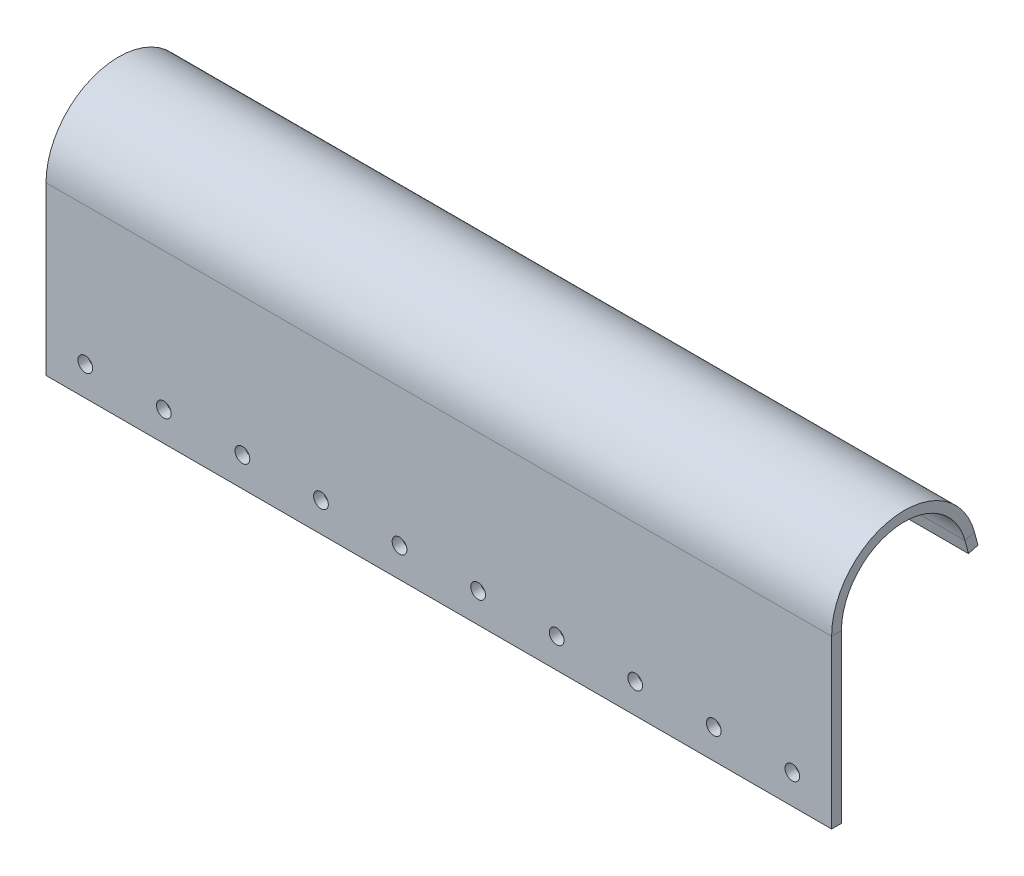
ISO-10303-21;
HEADER;
FILE_DESCRIPTION(('STEP AP214'),'2;1');
FILE_NAME('part.step','',(''),(''),'','','');
FILE_SCHEMA(('AUTOMOTIVE_DESIGN { 1 0 10303 214 1 1 1 1 }'));
ENDSEC;
DATA;
#1=APPLICATION_CONTEXT('core data for automotive mechanical design processes');
#2=APPLICATION_PROTOCOL_DEFINITION('international standard','automotive_design',2000,#1);
#3=PRODUCT_CONTEXT('',#1,'mechanical');
#4=PRODUCT('Part','Part','',(#3));
#5=PRODUCT_RELATED_PRODUCT_CATEGORY('part','',(#4));
#6=PRODUCT_DEFINITION_FORMATION('','',#4);
#7=PRODUCT_DEFINITION_CONTEXT('part definition',#1,'design');
#8=PRODUCT_DEFINITION('design','',#6,#7);
#9=PRODUCT_DEFINITION_SHAPE('','',#8);
#10=(LENGTH_UNIT() NAMED_UNIT(*) SI_UNIT(.MILLI.,.METRE.));
#11=(NAMED_UNIT(*) PLANE_ANGLE_UNIT() SI_UNIT($,.RADIAN.));
#12=(NAMED_UNIT(*) SI_UNIT($,.STERADIAN.) SOLID_ANGLE_UNIT());
#13=UNCERTAINTY_MEASURE_WITH_UNIT(LENGTH_MEASURE(1.E-05),#10,'distance_accuracy_value','');
#14=(GEOMETRIC_REPRESENTATION_CONTEXT(3) GLOBAL_UNCERTAINTY_ASSIGNED_CONTEXT((#13)) GLOBAL_UNIT_ASSIGNED_CONTEXT((#10,
#11,#12)) REPRESENTATION_CONTEXT('',''));
#15=CARTESIAN_POINT('',(0.,0.,0.));
#16=DIRECTION('',(0.,0.,1.));
#17=DIRECTION('',(1.,0.,0.));
#18=AXIS2_PLACEMENT_3D('',#15,#16,#17);
#19=CARTESIAN_POINT('',(127.,-25.4,-3.175));
#20=DIRECTION('',(1.,0.,0.));
#21=DIRECTION('',(0.,0.,-1.));
#22=AXIS2_PLACEMENT_3D('',#19,#20,#21);
#23=PLANE('',#22);
#24=DIRECTION('',(0.,1.,0.));
#25=VECTOR('',#24,1.);
#26=CARTESIAN_POINT('',(127.,-25.4,0.));
#27=LINE('',#26,#25);
#28=CARTESIAN_POINT('',(127.,-25.4,0.));
#29=VERTEX_POINT('',#28);
#30=CARTESIAN_POINT('',(127.,28.575,-1.04083408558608E-13));
#31=VERTEX_POINT('',#30);
#32=EDGE_CURVE('E210',#29,#31,#27,.T.);
#33=ORIENTED_EDGE('',*,*,#32,.F.);
#34=DIRECTION('',(0.,0.,1.));
#35=VECTOR('',#34,1.);
#36=CARTESIAN_POINT('',(127.,-25.4,-3.175));
#37=LINE('',#36,#35);
#38=CARTESIAN_POINT('',(127.,-25.4,-3.175));
#39=VERTEX_POINT('',#38);
#40=EDGE_CURVE('E14',#39,#29,#37,.T.);
#41=ORIENTED_EDGE('',*,*,#40,.F.);
#42=DIRECTION('',(0.,1.,0.));
#43=VECTOR('',#42,1.);
#44=CARTESIAN_POINT('',(127.,-25.4,-3.175));
#45=LINE('',#44,#43);
#46=CARTESIAN_POINT('',(127.,28.575,-3.1750000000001));
#47=VERTEX_POINT('',#46);
#48=EDGE_CURVE('E212',#39,#47,#45,.T.);
#49=ORIENTED_EDGE('',*,*,#48,.T.);
#50=DIRECTION('',(0.,0.,1.));
#51=VECTOR('',#50,1.);
#52=CARTESIAN_POINT('',(127.,28.575,-3.1750000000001));
#53=LINE('',#52,#51);
#54=EDGE_CURVE('E197',#47,#31,#53,.T.);
#55=ORIENTED_EDGE('',*,*,#54,.T.);
#56=EDGE_LOOP('',(#33,#41,#49,#55));
#57=FACE_BOUND('',#56,.T.);
#58=ADVANCED_FACE('F66',(#57),#23,.T.);
#59=CARTESIAN_POINT('',(-127.,-25.4,-3.175));
#60=DIRECTION('',(0.,-1.,0.));
#61=DIRECTION('',(0.,0.,-1.));
#62=AXIS2_PLACEMENT_3D('',#59,#60,#61);
#63=PLANE('',#62);
#64=DIRECTION('',(1.,0.,0.));
#65=VECTOR('',#64,1.);
#66=CARTESIAN_POINT('',(-127.,-25.4,0.));
#67=LINE('',#66,#65);
#68=CARTESIAN_POINT('',(-127.,-25.4,0.));
#69=VERTEX_POINT('',#68);
#70=EDGE_CURVE('E217',#69,#29,#67,.T.);
#71=ORIENTED_EDGE('',*,*,#70,.F.);
#72=DIRECTION('',(0.,0.,1.));
#73=VECTOR('',#72,1.);
#74=CARTESIAN_POINT('',(-127.,-25.4,-3.175));
#75=LINE('',#74,#73);
#76=CARTESIAN_POINT('',(-127.,-25.4,-3.175));
#77=VERTEX_POINT('',#76);
#78=EDGE_CURVE('E69',#77,#69,#75,.T.);
#79=ORIENTED_EDGE('',*,*,#78,.F.);
#80=DIRECTION('',(1.,0.,0.));
#81=VECTOR('',#80,1.);
#82=CARTESIAN_POINT('',(-127.,-25.4,-3.175));
#83=LINE('',#82,#81);
#84=EDGE_CURVE('E219',#77,#39,#83,.T.);
#85=ORIENTED_EDGE('',*,*,#84,.T.);
#86=ORIENTED_EDGE('',*,*,#40,.T.);
#87=EDGE_LOOP('',(#71,#79,#85,#86));
#88=FACE_BOUND('',#87,.T.);
#89=ADVANCED_FACE('F231',(#88),#63,.T.);
#90=CARTESIAN_POINT('',(-127.,-25.4,-3.175));
#91=DIRECTION('',(-1.,0.,0.));
#92=DIRECTION('',(0.,0.,1.));
#93=AXIS2_PLACEMENT_3D('',#90,#91,#92);
#94=PLANE('',#93);
#95=DIRECTION('',(0.,-1.,0.));
#96=VECTOR('',#95,1.);
#97=CARTESIAN_POINT('',(-127.,-25.4,0.));
#98=LINE('',#97,#96);
#99=CARTESIAN_POINT('',(-127.,28.575,0.));
#100=VERTEX_POINT('',#99);
#101=EDGE_CURVE('E224',#100,#69,#98,.T.);
#102=ORIENTED_EDGE('',*,*,#101,.F.);
#103=DIRECTION('',(0.,0.,1.));
#104=VECTOR('',#103,1.);
#105=CARTESIAN_POINT('',(-127.,28.575,-3.175));
#106=LINE('',#105,#104);
#107=CARTESIAN_POINT('',(-127.,28.575,-3.175));
#108=VERTEX_POINT('',#107);
#109=EDGE_CURVE('E208',#108,#100,#106,.T.);
#110=ORIENTED_EDGE('',*,*,#109,.F.);
#111=DIRECTION('',(0.,-1.,0.));
#112=VECTOR('',#111,1.);
#113=CARTESIAN_POINT('',(-127.,-25.4,-3.175));
#114=LINE('',#113,#112);
#115=EDGE_CURVE('E216',#108,#77,#114,.T.);
#116=ORIENTED_EDGE('',*,*,#115,.T.);
#117=ORIENTED_EDGE('',*,*,#78,.T.);
#118=EDGE_LOOP('',(#102,#110,#116,#117));
#119=FACE_BOUND('',#118,.T.);
#120=ADVANCED_FACE('F320',(#119),#94,.T.);
#121=CARTESIAN_POINT('',(0.,0.,-3.175));
#122=DIRECTION('',(0.,0.,-1.));
#123=DIRECTION('',(-1.,0.,0.));
#124=AXIS2_PLACEMENT_3D('',#121,#122,#123);
#125=PLANE('',#124);
#126=CARTESIAN_POINT('',(114.3,-15.875000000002,-3.175));
#127=DIRECTION('',(0.,0.,-1.));
#128=DIRECTION('',(-1.,0.,0.));
#129=AXIS2_PLACEMENT_3D('',#126,#127,#128);
#130=CIRCLE('',#129,2.38125000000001);
#131=CARTESIAN_POINT('',(111.91875,-15.875000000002,-3.175));
#132=VERTEX_POINT('',#131);
#133=EDGE_CURVE('E302',#132,#132,#130,.T.);
#134=ORIENTED_EDGE('',*,*,#133,.F.);
#135=EDGE_LOOP('',(#134));
#136=FACE_BOUND('',#135,.T.);
#137=CARTESIAN_POINT('',(88.9,-15.8750000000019,-3.175));
#138=DIRECTION('',(0.,0.,-1.));
#139=DIRECTION('',(-1.,0.,0.));
#140=AXIS2_PLACEMENT_3D('',#137,#138,#139);
#141=CIRCLE('',#140,2.38125000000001);
#142=CARTESIAN_POINT('',(86.51875,-15.8750000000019,-3.175));
#143=VERTEX_POINT('',#142);
#144=EDGE_CURVE('E296',#143,#143,#141,.T.);
#145=ORIENTED_EDGE('',*,*,#144,.F.);
#146=EDGE_LOOP('',(#145));
#147=FACE_BOUND('',#146,.T.);
#148=CARTESIAN_POINT('',(63.5,-15.8750000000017,-3.175));
#149=DIRECTION('',(0.,0.,-1.));
#150=DIRECTION('',(-1.,0.,0.));
#151=AXIS2_PLACEMENT_3D('',#148,#149,#150);
#152=CIRCLE('',#151,2.38125000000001);
#153=CARTESIAN_POINT('',(61.1187499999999,-15.8750000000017,-3.175));
#154=VERTEX_POINT('',#153);
#155=EDGE_CURVE('E290',#154,#154,#152,.T.);
#156=ORIENTED_EDGE('',*,*,#155,.F.);
#157=EDGE_LOOP('',(#156));
#158=FACE_BOUND('',#157,.T.);
#159=CARTESIAN_POINT('',(38.1,-15.8750000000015,-3.175));
#160=DIRECTION('',(0.,0.,-1.));
#161=DIRECTION('',(-1.,0.,0.));
#162=AXIS2_PLACEMENT_3D('',#159,#160,#161);
#163=CIRCLE('',#162,2.38125000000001);
#164=CARTESIAN_POINT('',(35.7187499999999,-15.8750000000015,-3.175));
#165=VERTEX_POINT('',#164);
#166=EDGE_CURVE('E284',#165,#165,#163,.T.);
#167=ORIENTED_EDGE('',*,*,#166,.F.);
#168=EDGE_LOOP('',(#167));
#169=FACE_BOUND('',#168,.T.);
#170=CARTESIAN_POINT('',(12.7,-15.8750000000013,-3.175));
#171=DIRECTION('',(0.,0.,-1.));
#172=DIRECTION('',(-1.,0.,0.));
#173=AXIS2_PLACEMENT_3D('',#170,#171,#172);
#174=CIRCLE('',#173,2.38125000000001);
#175=CARTESIAN_POINT('',(10.31875,-15.8750000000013,-3.175));
#176=VERTEX_POINT('',#175);
#177=EDGE_CURVE('E278',#176,#176,#174,.T.);
#178=ORIENTED_EDGE('',*,*,#177,.F.);
#179=EDGE_LOOP('',(#178));
#180=FACE_BOUND('',#179,.T.);
#181=CARTESIAN_POINT('',(-12.7,-15.8750000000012,-3.175));
#182=DIRECTION('',(0.,0.,-1.));
#183=DIRECTION('',(-1.,0.,0.));
#184=AXIS2_PLACEMENT_3D('',#181,#182,#183);
#185=CIRCLE('',#184,2.38125);
#186=CARTESIAN_POINT('',(-15.08125,-15.8750000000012,-3.175));
#187=VERTEX_POINT('',#186);
#188=EDGE_CURVE('E272',#187,#187,#185,.T.);
#189=ORIENTED_EDGE('',*,*,#188,.F.);
#190=EDGE_LOOP('',(#189));
#191=FACE_BOUND('',#190,.T.);
#192=CARTESIAN_POINT('',(-38.1,-15.875000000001,-3.175));
#193=DIRECTION('',(0.,0.,-1.));
#194=DIRECTION('',(-1.,0.,0.));
#195=AXIS2_PLACEMENT_3D('',#192,#193,#194);
#196=CIRCLE('',#195,2.38125);
#197=CARTESIAN_POINT('',(-40.48125,-15.875000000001,-3.175));
#198=VERTEX_POINT('',#197);
#199=EDGE_CURVE('E266',#198,#198,#196,.T.);
#200=ORIENTED_EDGE('',*,*,#199,.F.);
#201=EDGE_LOOP('',(#200));
#202=FACE_BOUND('',#201,.T.);
#203=CARTESIAN_POINT('',(-63.5,-15.8750000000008,-3.175));
#204=DIRECTION('',(0.,0.,-1.));
#205=DIRECTION('',(-1.,0.,0.));
#206=AXIS2_PLACEMENT_3D('',#203,#204,#205);
#207=CIRCLE('',#206,2.38125000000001);
#208=CARTESIAN_POINT('',(-65.88125,-15.8750000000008,-3.175));
#209=VERTEX_POINT('',#208);
#210=EDGE_CURVE('E260',#209,#209,#207,.T.);
#211=ORIENTED_EDGE('',*,*,#210,.F.);
#212=EDGE_LOOP('',(#211));
#213=FACE_BOUND('',#212,.T.);
#214=CARTESIAN_POINT('',(-88.9,-15.8750000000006,-3.175));
#215=DIRECTION('',(0.,0.,-1.));
#216=DIRECTION('',(-1.,0.,0.));
#217=AXIS2_PLACEMENT_3D('',#214,#215,#216);
#218=CIRCLE('',#217,2.38125000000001);
#219=CARTESIAN_POINT('',(-91.28125,-15.8750000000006,-3.175));
#220=VERTEX_POINT('',#219);
#221=EDGE_CURVE('E254',#220,#220,#218,.T.);
#222=ORIENTED_EDGE('',*,*,#221,.F.);
#223=EDGE_LOOP('',(#222));
#224=FACE_BOUND('',#223,.T.);
#225=CARTESIAN_POINT('',(-114.3,-15.8750000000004,-3.175));
#226=DIRECTION('',(0.,0.,-1.));
#227=DIRECTION('',(-1.,0.,0.));
#228=AXIS2_PLACEMENT_3D('',#225,#226,#227);
#229=CIRCLE('',#228,2.38125000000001);
#230=CARTESIAN_POINT('',(-116.68125,-15.8750000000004,-3.175));
#231=VERTEX_POINT('',#230);
#232=EDGE_CURVE('E248',#231,#231,#229,.T.);
#233=ORIENTED_EDGE('',*,*,#232,.F.);
#234=EDGE_LOOP('',(#233));
#235=FACE_BOUND('',#234,.T.);
#236=ORIENTED_EDGE('',*,*,#48,.F.);
#237=ORIENTED_EDGE('',*,*,#84,.F.);
#238=ORIENTED_EDGE('',*,*,#115,.F.);
#239=DIRECTION('',(1.,0.,0.));
#240=VECTOR('',#239,1.);
#241=CARTESIAN_POINT('',(127.,28.575,-3.1750000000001));
#242=LINE('',#241,#240);
#243=EDGE_CURVE('E203',#47,#108,#242,.F.);
#244=ORIENTED_EDGE('',*,*,#243,.F.);
#245=EDGE_LOOP('',(#236,#237,#238,#244));
#246=FACE_BOUND('',#245,.T.);
#247=ADVANCED_FACE('F317',(#136,#147,#158,#169,#180,#191,#202,#213,#224,#235,#246),#125,.T.);
#248=CARTESIAN_POINT('',(0.,0.,0.));
#249=DIRECTION('',(0.,0.,-1.));
#250=DIRECTION('',(-1.,0.,0.));
#251=AXIS2_PLACEMENT_3D('',#248,#249,#250);
#252=PLANE('',#251);
#253=CARTESIAN_POINT('',(114.3,-15.875000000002,0.));
#254=DIRECTION('',(0.,0.,-1.));
#255=DIRECTION('',(-1.,0.,0.));
#256=AXIS2_PLACEMENT_3D('',#253,#254,#255);
#257=CIRCLE('',#256,2.38125000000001);
#258=CARTESIAN_POINT('',(111.91875,-15.875000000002,0.));
#259=VERTEX_POINT('',#258);
#260=EDGE_CURVE('E299',#259,#259,#257,.T.);
#261=ORIENTED_EDGE('',*,*,#260,.T.);
#262=EDGE_LOOP('',(#261));
#263=FACE_BOUND('',#262,.T.);
#264=CARTESIAN_POINT('',(88.9,-15.8750000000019,0.));
#265=DIRECTION('',(0.,0.,-1.));
#266=DIRECTION('',(-1.,0.,0.));
#267=AXIS2_PLACEMENT_3D('',#264,#265,#266);
#268=CIRCLE('',#267,2.38125000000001);
#269=CARTESIAN_POINT('',(86.51875,-15.8750000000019,0.));
#270=VERTEX_POINT('',#269);
#271=EDGE_CURVE('E293',#270,#270,#268,.T.);
#272=ORIENTED_EDGE('',*,*,#271,.T.);
#273=EDGE_LOOP('',(#272));
#274=FACE_BOUND('',#273,.T.);
#275=CARTESIAN_POINT('',(63.5,-15.8750000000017,0.));
#276=DIRECTION('',(0.,0.,-1.));
#277=DIRECTION('',(-1.,0.,0.));
#278=AXIS2_PLACEMENT_3D('',#275,#276,#277);
#279=CIRCLE('',#278,2.38125000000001);
#280=CARTESIAN_POINT('',(61.1187499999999,-15.8750000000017,0.));
#281=VERTEX_POINT('',#280);
#282=EDGE_CURVE('E287',#281,#281,#279,.T.);
#283=ORIENTED_EDGE('',*,*,#282,.T.);
#284=EDGE_LOOP('',(#283));
#285=FACE_BOUND('',#284,.T.);
#286=CARTESIAN_POINT('',(38.1,-15.8750000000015,0.));
#287=DIRECTION('',(0.,0.,-1.));
#288=DIRECTION('',(-1.,0.,0.));
#289=AXIS2_PLACEMENT_3D('',#286,#287,#288);
#290=CIRCLE('',#289,2.38125000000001);
#291=CARTESIAN_POINT('',(35.7187499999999,-15.8750000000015,0.));
#292=VERTEX_POINT('',#291);
#293=EDGE_CURVE('E281',#292,#292,#290,.T.);
#294=ORIENTED_EDGE('',*,*,#293,.T.);
#295=EDGE_LOOP('',(#294));
#296=FACE_BOUND('',#295,.T.);
#297=CARTESIAN_POINT('',(12.7,-15.8750000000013,0.));
#298=DIRECTION('',(0.,0.,-1.));
#299=DIRECTION('',(-1.,0.,0.));
#300=AXIS2_PLACEMENT_3D('',#297,#298,#299);
#301=CIRCLE('',#300,2.38125000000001);
#302=CARTESIAN_POINT('',(10.31875,-15.8750000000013,0.));
#303=VERTEX_POINT('',#302);
#304=EDGE_CURVE('E275',#303,#303,#301,.T.);
#305=ORIENTED_EDGE('',*,*,#304,.T.);
#306=EDGE_LOOP('',(#305));
#307=FACE_BOUND('',#306,.T.);
#308=CARTESIAN_POINT('',(-12.7,-15.8750000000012,0.));
#309=DIRECTION('',(0.,0.,-1.));
#310=DIRECTION('',(-1.,0.,0.));
#311=AXIS2_PLACEMENT_3D('',#308,#309,#310);
#312=CIRCLE('',#311,2.38125);
#313=CARTESIAN_POINT('',(-15.08125,-15.8750000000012,0.));
#314=VERTEX_POINT('',#313);
#315=EDGE_CURVE('E269',#314,#314,#312,.T.);
#316=ORIENTED_EDGE('',*,*,#315,.T.);
#317=EDGE_LOOP('',(#316));
#318=FACE_BOUND('',#317,.T.);
#319=CARTESIAN_POINT('',(-38.1,-15.875000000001,0.));
#320=DIRECTION('',(0.,0.,-1.));
#321=DIRECTION('',(-1.,0.,0.));
#322=AXIS2_PLACEMENT_3D('',#319,#320,#321);
#323=CIRCLE('',#322,2.38125);
#324=CARTESIAN_POINT('',(-40.48125,-15.875000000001,0.));
#325=VERTEX_POINT('',#324);
#326=EDGE_CURVE('E263',#325,#325,#323,.T.);
#327=ORIENTED_EDGE('',*,*,#326,.T.);
#328=EDGE_LOOP('',(#327));
#329=FACE_BOUND('',#328,.T.);
#330=CARTESIAN_POINT('',(-63.5,-15.8750000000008,0.));
#331=DIRECTION('',(0.,0.,-1.));
#332=DIRECTION('',(-1.,0.,0.));
#333=AXIS2_PLACEMENT_3D('',#330,#331,#332);
#334=CIRCLE('',#333,2.38125000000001);
#335=CARTESIAN_POINT('',(-65.88125,-15.8750000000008,0.));
#336=VERTEX_POINT('',#335);
#337=EDGE_CURVE('E257',#336,#336,#334,.T.);
#338=ORIENTED_EDGE('',*,*,#337,.T.);
#339=EDGE_LOOP('',(#338));
#340=FACE_BOUND('',#339,.T.);
#341=CARTESIAN_POINT('',(-88.9,-15.8750000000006,0.));
#342=DIRECTION('',(0.,0.,-1.));
#343=DIRECTION('',(-1.,0.,0.));
#344=AXIS2_PLACEMENT_3D('',#341,#342,#343);
#345=CIRCLE('',#344,2.38125000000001);
#346=CARTESIAN_POINT('',(-91.28125,-15.8750000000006,0.));
#347=VERTEX_POINT('',#346);
#348=EDGE_CURVE('E251',#347,#347,#345,.T.);
#349=ORIENTED_EDGE('',*,*,#348,.T.);
#350=EDGE_LOOP('',(#349));
#351=FACE_BOUND('',#350,.T.);
#352=CARTESIAN_POINT('',(-114.3,-15.8750000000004,0.));
#353=DIRECTION('',(0.,0.,-1.));
#354=DIRECTION('',(-1.,0.,0.));
#355=AXIS2_PLACEMENT_3D('',#352,#353,#354);
#356=CIRCLE('',#355,2.38125000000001);
#357=CARTESIAN_POINT('',(-116.68125,-15.8750000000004,0.));
#358=VERTEX_POINT('',#357);
#359=EDGE_CURVE('E191',#358,#358,#356,.T.);
#360=ORIENTED_EDGE('',*,*,#359,.T.);
#361=EDGE_LOOP('',(#360));
#362=FACE_BOUND('',#361,.T.);
#363=ORIENTED_EDGE('',*,*,#32,.T.);
#364=DIRECTION('',(1.,0.,0.));
#365=VECTOR('',#364,1.);
#366=CARTESIAN_POINT('',(127.,28.575,-1.04083408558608E-13));
#367=LINE('',#366,#365);
#368=EDGE_CURVE('E192',#31,#100,#367,.F.);
#369=ORIENTED_EDGE('',*,*,#368,.T.);
#370=ORIENTED_EDGE('',*,*,#101,.T.);
#371=ORIENTED_EDGE('',*,*,#70,.T.);
#372=EDGE_LOOP('',(#363,#369,#370,#371));
#373=FACE_BOUND('',#372,.T.);
#374=ADVANCED_FACE('F229',(#263,#274,#285,#296,#307,#318,#329,#340,#351,#362,#373),#252,.F.);
#375=CARTESIAN_POINT('',(-127.,28.575,-23.495));
#376=DIRECTION('',(-1.,0.,0.));
#377=DIRECTION('',(0.,0.,1.));
#378=AXIS2_PLACEMENT_3D('',#375,#376,#377);
#379=PLANE('',#378);
#380=DIRECTION('',(0.,-0.258819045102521,0.965925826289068));
#381=VECTOR('',#380,1.);
#382=CARTESIAN_POINT('',(-127.,34.6559534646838,-46.1894272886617));
#383=LINE('',#382,#381);
#384=CARTESIAN_POINT('',(-127.,33.8342029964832,-43.1226127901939));
#385=VERTEX_POINT('',#384);
#386=CARTESIAN_POINT('',(-127.,34.6559534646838,-46.1894272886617));
#387=VERTEX_POINT('',#386);
#388=EDGE_CURVE('E173',#385,#387,#383,.F.);
#389=ORIENTED_EDGE('',*,*,#388,.F.);
#390=CARTESIAN_POINT('',(-127.,28.575,-23.495));
#391=DIRECTION('',(1.,0.,0.));
#392=DIRECTION('',(0.,0.,-1.));
#393=AXIS2_PLACEMENT_3D('',#390,#391,#392);
#394=CIRCLE('',#393,20.32);
#395=EDGE_CURVE('E200',#108,#385,#394,.F.);
#396=ORIENTED_EDGE('',*,*,#395,.F.);
#397=ORIENTED_EDGE('',*,*,#109,.T.);
#398=CARTESIAN_POINT('',(-127.,28.575,-23.495));
#399=DIRECTION('',(1.,0.,0.));
#400=DIRECTION('',(0.,0.,-1.));
#401=AXIS2_PLACEMENT_3D('',#398,#399,#400);
#402=CIRCLE('',#401,23.495);
#403=EDGE_CURVE('E106',#100,#387,#402,.F.);
#404=ORIENTED_EDGE('',*,*,#403,.T.);
#405=EDGE_LOOP('',(#389,#396,#397,#404));
#406=FACE_BOUND('',#405,.T.);
#407=ADVANCED_FACE('F343',(#406),#379,.T.);
#408=CARTESIAN_POINT('',(127.,28.575,-23.4950000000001));
#409=DIRECTION('',(-1.,0.,0.));
#410=DIRECTION('',(0.,0.,1.));
#411=AXIS2_PLACEMENT_3D('',#408,#409,#410);
#412=PLANE('',#411);
#413=CARTESIAN_POINT('',(127.,28.575,-23.4950000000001));
#414=DIRECTION('',(1.,0.,0.));
#415=DIRECTION('',(0.,0.,-1.));
#416=AXIS2_PLACEMENT_3D('',#413,#414,#415);
#417=CIRCLE('',#416,20.32);
#418=CARTESIAN_POINT('',(127.,33.8342029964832,-43.122612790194));
#419=VERTEX_POINT('',#418);
#420=EDGE_CURVE('E205',#419,#47,#417,.T.);
#421=ORIENTED_EDGE('',*,*,#420,.F.);
#422=DIRECTION('',(0.,-0.258819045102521,0.965925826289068));
#423=VECTOR('',#422,1.);
#424=CARTESIAN_POINT('',(127.,33.8342029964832,-43.1226127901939));
#425=LINE('',#424,#423);
#426=CARTESIAN_POINT('',(127.,34.6559534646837,-46.1894272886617));
#427=VERTEX_POINT('',#426);
#428=EDGE_CURVE('E185',#419,#427,#425,.F.);
#429=ORIENTED_EDGE('',*,*,#428,.T.);
#430=CARTESIAN_POINT('',(127.,28.575,-23.4950000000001));
#431=DIRECTION('',(1.,0.,0.));
#432=DIRECTION('',(0.,0.,-1.));
#433=AXIS2_PLACEMENT_3D('',#430,#431,#432);
#434=CIRCLE('',#433,23.495);
#435=EDGE_CURVE('E195',#427,#31,#434,.T.);
#436=ORIENTED_EDGE('',*,*,#435,.T.);
#437=ORIENTED_EDGE('',*,*,#54,.F.);
#438=EDGE_LOOP('',(#421,#429,#436,#437));
#439=FACE_BOUND('',#438,.T.);
#440=ADVANCED_FACE('F236',(#439),#412,.F.);
#441=CARTESIAN_POINT('',(127.,28.575,-23.4950000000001));
#442=DIRECTION('',(1.,0.,0.));
#443=DIRECTION('',(0.,0.258819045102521,-0.965925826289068));
#444=AXIS2_PLACEMENT_3D('',#441,#442,#443);
#445=CYLINDRICAL_SURFACE('',#444,23.495);
#446=ORIENTED_EDGE('',*,*,#368,.F.);
#447=ORIENTED_EDGE('',*,*,#435,.F.);
#448=DIRECTION('',(1.,0.,0.));
#449=VECTOR('',#448,1.);
#450=CARTESIAN_POINT('',(-127.,34.6559534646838,-46.1894272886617));
#451=LINE('',#450,#449);
#452=EDGE_CURVE('E183',#427,#387,#451,.F.);
#453=ORIENTED_EDGE('',*,*,#452,.T.);
#454=ORIENTED_EDGE('',*,*,#403,.F.);
#455=EDGE_LOOP('',(#446,#447,#453,#454));
#456=FACE_BOUND('',#455,.T.);
#457=ADVANCED_FACE('F350',(#456),#445,.T.);
#458=CARTESIAN_POINT('',(127.,28.575,-23.4950000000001));
#459=DIRECTION('',(1.,0.,0.));
#460=DIRECTION('',(0.,0.258819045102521,-0.965925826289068));
#461=AXIS2_PLACEMENT_3D('',#458,#459,#460);
#462=CYLINDRICAL_SURFACE('',#461,20.32);
#463=ORIENTED_EDGE('',*,*,#243,.T.);
#464=ORIENTED_EDGE('',*,*,#395,.T.);
#465=DIRECTION('',(1.,0.,0.));
#466=VECTOR('',#465,1.);
#467=CARTESIAN_POINT('',(-127.,33.8342029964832,-43.1226127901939));
#468=LINE('',#467,#466);
#469=EDGE_CURVE('E188',#385,#419,#468,.T.);
#470=ORIENTED_EDGE('',*,*,#469,.T.);
#471=ORIENTED_EDGE('',*,*,#420,.T.);
#472=EDGE_LOOP('',(#463,#464,#470,#471));
#473=FACE_BOUND('',#472,.T.);
#474=ADVANCED_FACE('F239',(#473),#462,.F.);
#475=CARTESIAN_POINT('',(127.,30.4017491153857,-47.3293379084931));
#476=DIRECTION('',(-1.,0.,0.));
#477=DIRECTION('',(0.,0.,1.));
#478=AXIS2_PLACEMENT_3D('',#475,#476,#477);
#479=PLANE('',#478);
#480=ORIENTED_EDGE('',*,*,#428,.F.);
#481=DIRECTION('',(0.,0.965925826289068,0.258819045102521));
#482=VECTOR('',#481,1.);
#483=CARTESIAN_POINT('',(127.,29.5799986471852,-44.2625234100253));
#484=LINE('',#483,#482);
#485=CARTESIAN_POINT('',(127.,29.5799986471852,-44.2625234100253));
#486=VERTEX_POINT('',#485);
#487=EDGE_CURVE('E181',#419,#486,#484,.F.);
#488=ORIENTED_EDGE('',*,*,#487,.T.);
#489=DIRECTION('',(0.,-0.258819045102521,0.965925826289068));
#490=VECTOR('',#489,1.);
#491=CARTESIAN_POINT('',(127.,30.4017491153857,-47.3293379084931));
#492=LINE('',#491,#490);
#493=CARTESIAN_POINT('',(127.,30.4017491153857,-47.3293379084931));
#494=VERTEX_POINT('',#493);
#495=EDGE_CURVE('E169',#494,#486,#492,.T.);
#496=ORIENTED_EDGE('',*,*,#495,.F.);
#497=DIRECTION('',(0.,-0.965925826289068,-0.258819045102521));
#498=VECTOR('',#497,1.);
#499=CARTESIAN_POINT('',(127.,160.837701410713,-12.3791298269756));
#500=LINE('',#499,#498);
#501=EDGE_CURVE('E156',#427,#494,#500,.T.);
#502=ORIENTED_EDGE('',*,*,#501,.F.);
#503=EDGE_LOOP('',(#480,#488,#496,#502));
#504=FACE_BOUND('',#503,.T.);
#505=ADVANCED_FACE('F246',(#504),#479,.F.);
#506=CARTESIAN_POINT('',(-127.,183.742474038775,-6.24181449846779));
#507=DIRECTION('',(1.,0.,0.));
#508=DIRECTION('',(0.,0.,-1.));
#509=AXIS2_PLACEMENT_3D('',#506,#507,#508);
#510=PLANE('',#509);
#511=ORIENTED_EDGE('',*,*,#388,.T.);
#512=DIRECTION('',(0.,0.965925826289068,0.258819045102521));
#513=VECTOR('',#512,1.);
#514=CARTESIAN_POINT('',(-127.,160.837701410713,-12.3791298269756));
#515=LINE('',#514,#513);
#516=CARTESIAN_POINT('',(-127.,30.4017491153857,-47.3293379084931));
#517=VERTEX_POINT('',#516);
#518=EDGE_CURVE('E154',#517,#387,#515,.T.);
#519=ORIENTED_EDGE('',*,*,#518,.F.);
#520=DIRECTION('',(0.,-0.258819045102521,0.965925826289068));
#521=VECTOR('',#520,1.);
#522=CARTESIAN_POINT('',(-127.,30.4017491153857,-47.3293379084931));
#523=LINE('',#522,#521);
#524=CARTESIAN_POINT('',(-127.,29.5799986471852,-44.2625234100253));
#525=VERTEX_POINT('',#524);
#526=EDGE_CURVE('E162',#517,#525,#523,.T.);
#527=ORIENTED_EDGE('',*,*,#526,.T.);
#528=DIRECTION('',(0.,-0.965925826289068,-0.258819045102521));
#529=VECTOR('',#528,1.);
#530=CARTESIAN_POINT('',(-127.,182.920723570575,-3.175));
#531=LINE('',#530,#529);
#532=EDGE_CURVE('E178',#525,#385,#531,.F.);
#533=ORIENTED_EDGE('',*,*,#532,.T.);
#534=EDGE_LOOP('',(#511,#519,#527,#533));
#535=FACE_BOUND('',#534,.T.);
#536=ADVANCED_FACE('F172',(#535),#510,.F.);
#537=CARTESIAN_POINT('',(0.,160.837701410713,-12.3791298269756));
#538=DIRECTION('',(0.,-0.258819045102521,0.965925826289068));
#539=DIRECTION('',(0.,-0.965925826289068,-0.258819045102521));
#540=AXIS2_PLACEMENT_3D('',#537,#538,#539);
#541=PLANE('',#540);
#542=ORIENTED_EDGE('',*,*,#452,.F.);
#543=ORIENTED_EDGE('',*,*,#501,.T.);
#544=DIRECTION('',(-1.,0.,0.));
#545=VECTOR('',#544,1.);
#546=CARTESIAN_POINT('',(0.,30.4017491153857,-47.3293379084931));
#547=LINE('',#546,#545);
#548=EDGE_CURVE('E149',#494,#517,#547,.T.);
#549=ORIENTED_EDGE('',*,*,#548,.T.);
#550=ORIENTED_EDGE('',*,*,#518,.T.);
#551=EDGE_LOOP('',(#542,#543,#549,#550));
#552=FACE_BOUND('',#551,.T.);
#553=ADVANCED_FACE('F152',(#552),#541,.F.);
#554=CARTESIAN_POINT('',(0.,160.015950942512,-9.31231532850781));
#555=DIRECTION('',(0.,-0.258819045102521,0.965925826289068));
#556=DIRECTION('',(0.,-0.965925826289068,-0.258819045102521));
#557=AXIS2_PLACEMENT_3D('',#554,#555,#556);
#558=PLANE('',#557);
#559=ORIENTED_EDGE('',*,*,#487,.F.);
#560=ORIENTED_EDGE('',*,*,#469,.F.);
#561=ORIENTED_EDGE('',*,*,#532,.F.);
#562=DIRECTION('',(1.,0.,0.));
#563=VECTOR('',#562,1.);
#564=CARTESIAN_POINT('',(-127.,29.5799986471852,-44.2625234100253));
#565=LINE('',#564,#563);
#566=EDGE_CURVE('E165',#486,#525,#565,.F.);
#567=ORIENTED_EDGE('',*,*,#566,.F.);
#568=EDGE_LOOP('',(#559,#560,#561,#567));
#569=FACE_BOUND('',#568,.T.);
#570=ADVANCED_FACE('F244',(#569),#558,.T.);
#571=CARTESIAN_POINT('',(-127.,30.4017491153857,-47.3293379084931));
#572=DIRECTION('',(0.,0.965925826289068,0.258819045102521));
#573=DIRECTION('',(0.,-0.258819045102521,0.965925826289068));
#574=AXIS2_PLACEMENT_3D('',#571,#572,#573);
#575=PLANE('',#574);
#576=ORIENTED_EDGE('',*,*,#566,.T.);
#577=ORIENTED_EDGE('',*,*,#526,.F.);
#578=ORIENTED_EDGE('',*,*,#548,.F.);
#579=ORIENTED_EDGE('',*,*,#495,.T.);
#580=EDGE_LOOP('',(#576,#577,#578,#579));
#581=FACE_BOUND('',#580,.T.);
#582=ADVANCED_FACE('F163',(#581),#575,.F.);
#583=CARTESIAN_POINT('',(-114.3,-15.8750000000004,0.));
#584=DIRECTION('',(0.,0.,-1.));
#585=DIRECTION('',(-1.,0.,0.));
#586=AXIS2_PLACEMENT_3D('',#583,#584,#585);
#587=CYLINDRICAL_SURFACE('',#586,2.38125000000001);
#588=ORIENTED_EDGE('',*,*,#359,.F.);
#589=EDGE_LOOP('',(#588));
#590=FACE_BOUND('',#589,.T.);
#591=ORIENTED_EDGE('',*,*,#232,.T.);
#592=EDGE_LOOP('',(#591));
#593=FACE_BOUND('',#592,.T.);
#594=ADVANCED_FACE('F384',(#590,#593),#587,.F.);
#595=CARTESIAN_POINT('',(-88.9,-15.8750000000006,0.));
#596=DIRECTION('',(0.,0.,-1.));
#597=DIRECTION('',(-1.,0.,0.));
#598=AXIS2_PLACEMENT_3D('',#595,#596,#597);
#599=CYLINDRICAL_SURFACE('',#598,2.38125000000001);
#600=ORIENTED_EDGE('',*,*,#348,.F.);
#601=EDGE_LOOP('',(#600));
#602=FACE_BOUND('',#601,.T.);
#603=ORIENTED_EDGE('',*,*,#221,.T.);
#604=EDGE_LOOP('',(#603));
#605=FACE_BOUND('',#604,.T.);
#606=ADVANCED_FACE('F389',(#602,#605),#599,.F.);
#607=CARTESIAN_POINT('',(-63.5,-15.8750000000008,0.));
#608=DIRECTION('',(0.,0.,-1.));
#609=DIRECTION('',(-1.,0.,0.));
#610=AXIS2_PLACEMENT_3D('',#607,#608,#609);
#611=CYLINDRICAL_SURFACE('',#610,2.38125000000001);
#612=ORIENTED_EDGE('',*,*,#337,.F.);
#613=EDGE_LOOP('',(#612));
#614=FACE_BOUND('',#613,.T.);
#615=ORIENTED_EDGE('',*,*,#210,.T.);
#616=EDGE_LOOP('',(#615));
#617=FACE_BOUND('',#616,.T.);
#618=ADVANCED_FACE('F402',(#614,#617),#611,.F.);
#619=CARTESIAN_POINT('',(-38.1,-15.875000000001,0.));
#620=DIRECTION('',(0.,0.,-1.));
#621=DIRECTION('',(-1.,0.,0.));
#622=AXIS2_PLACEMENT_3D('',#619,#620,#621);
#623=CYLINDRICAL_SURFACE('',#622,2.38125);
#624=ORIENTED_EDGE('',*,*,#326,.F.);
#625=EDGE_LOOP('',(#624));
#626=FACE_BOUND('',#625,.T.);
#627=ORIENTED_EDGE('',*,*,#199,.T.);
#628=EDGE_LOOP('',(#627));
#629=FACE_BOUND('',#628,.T.);
#630=ADVANCED_FACE('F413',(#626,#629),#623,.F.);
#631=CARTESIAN_POINT('',(-12.7,-15.8750000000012,0.));
#632=DIRECTION('',(0.,0.,-1.));
#633=DIRECTION('',(-1.,0.,0.));
#634=AXIS2_PLACEMENT_3D('',#631,#632,#633);
#635=CYLINDRICAL_SURFACE('',#634,2.38125);
#636=ORIENTED_EDGE('',*,*,#315,.F.);
#637=EDGE_LOOP('',(#636));
#638=FACE_BOUND('',#637,.T.);
#639=ORIENTED_EDGE('',*,*,#188,.T.);
#640=EDGE_LOOP('',(#639));
#641=FACE_BOUND('',#640,.T.);
#642=ADVANCED_FACE('F424',(#638,#641),#635,.F.);
#643=CARTESIAN_POINT('',(12.7,-15.8750000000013,0.));
#644=DIRECTION('',(0.,0.,-1.));
#645=DIRECTION('',(-1.,0.,0.));
#646=AXIS2_PLACEMENT_3D('',#643,#644,#645);
#647=CYLINDRICAL_SURFACE('',#646,2.38125000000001);
#648=ORIENTED_EDGE('',*,*,#304,.F.);
#649=EDGE_LOOP('',(#648));
#650=FACE_BOUND('',#649,.T.);
#651=ORIENTED_EDGE('',*,*,#177,.T.);
#652=EDGE_LOOP('',(#651));
#653=FACE_BOUND('',#652,.T.);
#654=ADVANCED_FACE('F435',(#650,#653),#647,.F.);
#655=CARTESIAN_POINT('',(38.1,-15.8750000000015,0.));
#656=DIRECTION('',(0.,0.,-1.));
#657=DIRECTION('',(-1.,0.,0.));
#658=AXIS2_PLACEMENT_3D('',#655,#656,#657);
#659=CYLINDRICAL_SURFACE('',#658,2.38125000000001);
#660=ORIENTED_EDGE('',*,*,#293,.F.);
#661=EDGE_LOOP('',(#660));
#662=FACE_BOUND('',#661,.T.);
#663=ORIENTED_EDGE('',*,*,#166,.T.);
#664=EDGE_LOOP('',(#663));
#665=FACE_BOUND('',#664,.T.);
#666=ADVANCED_FACE('F446',(#662,#665),#659,.F.);
#667=CARTESIAN_POINT('',(63.5,-15.8750000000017,0.));
#668=DIRECTION('',(0.,0.,-1.));
#669=DIRECTION('',(-1.,0.,0.));
#670=AXIS2_PLACEMENT_3D('',#667,#668,#669);
#671=CYLINDRICAL_SURFACE('',#670,2.38125000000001);
#672=ORIENTED_EDGE('',*,*,#282,.F.);
#673=EDGE_LOOP('',(#672));
#674=FACE_BOUND('',#673,.T.);
#675=ORIENTED_EDGE('',*,*,#155,.T.);
#676=EDGE_LOOP('',(#675));
#677=FACE_BOUND('',#676,.T.);
#678=ADVANCED_FACE('F457',(#674,#677),#671,.F.);
#679=CARTESIAN_POINT('',(88.9,-15.8750000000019,0.));
#680=DIRECTION('',(0.,0.,-1.));
#681=DIRECTION('',(-1.,0.,0.));
#682=AXIS2_PLACEMENT_3D('',#679,#680,#681);
#683=CYLINDRICAL_SURFACE('',#682,2.38125000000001);
#684=ORIENTED_EDGE('',*,*,#271,.F.);
#685=EDGE_LOOP('',(#684));
#686=FACE_BOUND('',#685,.T.);
#687=ORIENTED_EDGE('',*,*,#144,.T.);
#688=EDGE_LOOP('',(#687));
#689=FACE_BOUND('',#688,.T.);
#690=ADVANCED_FACE('F313',(#686,#689),#683,.F.);
#691=CARTESIAN_POINT('',(114.3,-15.875000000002,0.));
#692=DIRECTION('',(0.,0.,-1.));
#693=DIRECTION('',(-1.,0.,0.));
#694=AXIS2_PLACEMENT_3D('',#691,#692,#693);
#695=CYLINDRICAL_SURFACE('',#694,2.38125000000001);
#696=ORIENTED_EDGE('',*,*,#260,.F.);
#697=EDGE_LOOP('',(#696));
#698=FACE_BOUND('',#697,.T.);
#699=ORIENTED_EDGE('',*,*,#133,.T.);
#700=EDGE_LOOP('',(#699));
#701=FACE_BOUND('',#700,.T.);
#702=ADVANCED_FACE('F310',(#698,#701),#695,.F.);
#703=CLOSED_SHELL('',(#58,#89,#120,#247,#374,#407,#440,#457,#474,#505,#536,#553,#570,#582,#594,
#606,#618,#630,#642,#654,#666,#678,#690,#702));
#704=MANIFOLD_SOLID_BREP('B2',#703);
#705=ADVANCED_BREP_SHAPE_REPRESENTATION('',(#18,#704),#14);
#706=SHAPE_DEFINITION_REPRESENTATION(#9,#705);
ENDSEC;
END-ISO-10303-21;
